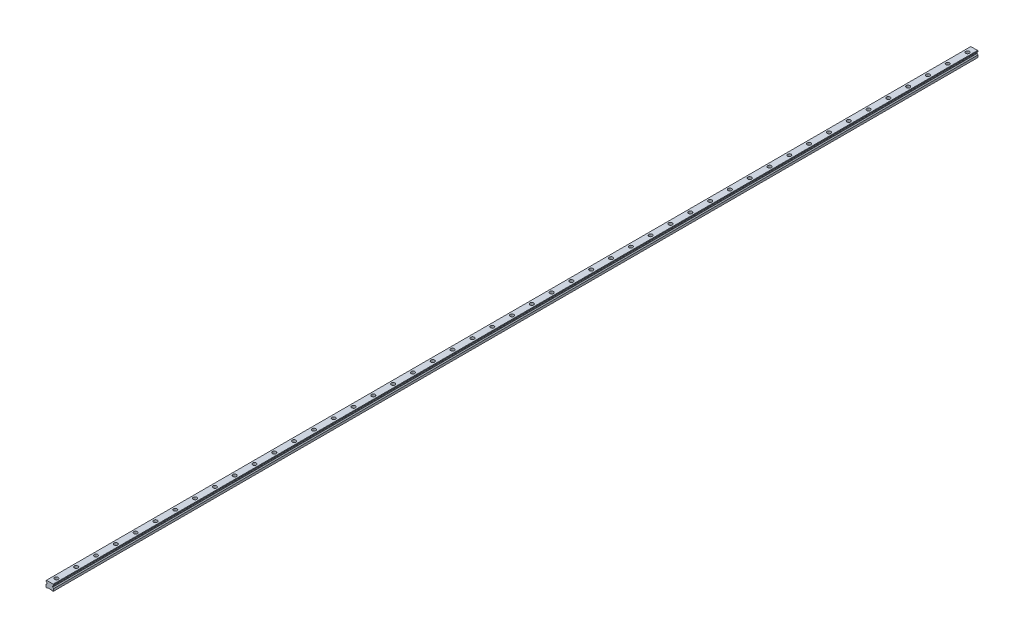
from build123d import *

# Parameters (mm, degrees)
SKETCH1_W           = 23
SKETCH1_H           = 19.2
BOSS_EXTRUDE1_DEPTH = 1400
CUT_EXTRUDE1_DEPTH  = 2801.089443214
CHAMFER1_SIZE       = 1.25
FILLET1_R           = 1.25
CUT_EXTRUDE2_DEPTH  = 2801.089443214
SKETCH4_R           = 5.5
SKETCH4_R_2         = 3.5
CUT_EXTRUDE3_DEPTH  = 9
SKETCH4_2_R         = 3.5
CUT_EXTRUDE4_DEPTH  = 1401.178877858
LPATTERN1_COUNT     = 47
LPATTERN1_PITCH     = 60


with BuildPart() as part:
    # Sketch1 → Boss-Extrude1 (new, symmetric)
    with BuildSketch(Plane.XY):
        with Locations((0, 9.6)):
            Rectangle(SKETCH1_W, SKETCH1_H)
    extrude(amount=BOSS_EXTRUDE1_DEPTH, both=True)

    # Sketch2 → Cut-Extrude1 (cut, through all)
    with BuildSketch(Plane.XY.offset(1400)):
        Polygon((-11.5, 16.7), (-11.5, 7.95), (-8.583333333, 10.866666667), (-8.583333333, 13.783333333), align=None)
        Polygon((8.583333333, 13.783333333), (11.5, 16.7), (11.5, 7.95), (8.583333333, 10.866666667), align=None)
    extrude(amount=-CUT_EXTRUDE1_DEPTH, mode=Mode.SUBTRACT)

    # Chamfer1
    chamfer1_edges = [part.edges().sort_by_distance(p)[0] for p in [
        (-11.5, 19.2, 0),
        (11.5, 19.2, 0),
        (11.5, 0, 0),
        (-11.5, 0, 0),
    ]]
    chamfer(chamfer1_edges, length=CHAMFER1_SIZE)

    # Fillet1
    fillet1_edges = [part.edges().sort_by_distance(p)[0] for p in [
        (-8.583333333, 13.783333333, 0),
        (-8.583333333, 10.866666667, 0),
        (8.583333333, 10.866666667, 0),
        (8.583333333, 13.783333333, 0),
    ]]
    fillet(fillet1_edges, radius=FILLET1_R)

    # Sketch3 → Cut-Extrude2 (cut, through all)
    with BuildSketch(Plane.XY.offset(1400)):
        Polygon((-7, 0), (-5.75, 1.25), (5.75, 1.25), (7, 0), align=None)
    extrude(amount=-CUT_EXTRUDE2_DEPTH, mode=Mode.SUBTRACT)

    # Sketch4 → Cut-Extrude3 (cut)
    with BuildSketch(Plane(origin=(0, 19.2, 0), x_dir=(1, 0, 0), z_dir=(0, 1, 0))):
        with Locations(Location((0, -1380, 0), (0, 0, 270))):
            Circle(SKETCH4_R)
        with Locations(Location((0, -1380, 0), (0, 0, 270))):
            Circle(SKETCH4_R_2, mode=Mode.SUBTRACT)
    cut_extrude3 = extrude(amount=-CUT_EXTRUDE3_DEPTH, mode=Mode.SUBTRACT)

    # Sketch4_2 → Cut-Extrude4 (cut, through all)
    with BuildSketch(Plane(origin=(0, 19.2, 0), x_dir=(1, 0, 0), z_dir=(0, 1, 0))):
        with Locations(Location((0, -1380, 0), (0, 0, 270))):
            Circle(SKETCH4_2_R)
    cut_extrude4 = extrude(amount=-CUT_EXTRUDE4_DEPTH, mode=Mode.SUBTRACT)

    # LPattern1: Cut-Extrude3, Cut-Extrude4 ×47
    with Locations(*[(0, 0, -i * LPATTERN1_PITCH) for i in range(1, LPATTERN1_COUNT)]):
        add(cut_extrude3, mode=Mode.SUBTRACT)
        add(cut_extrude4, mode=Mode.SUBTRACT)


solid = part.part
